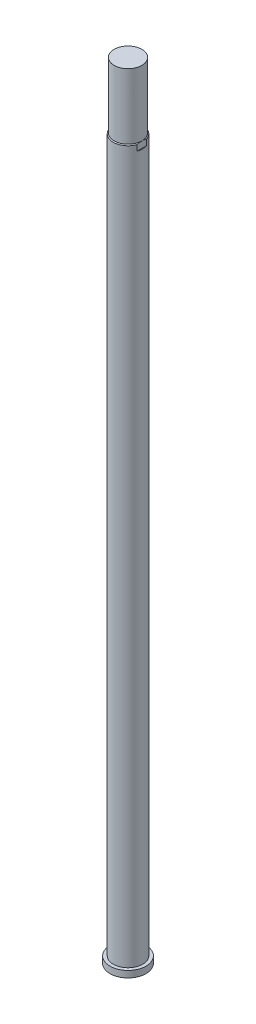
ISO-10303-21;
HEADER;
FILE_DESCRIPTION(('STEP AP214'),'2;1');
FILE_NAME('part.step','',(''),(''),'','','');
FILE_SCHEMA(('AUTOMOTIVE_DESIGN { 1 0 10303 214 1 1 1 1 }'));
ENDSEC;
DATA;
#1=APPLICATION_CONTEXT('core data for automotive mechanical design processes');
#2=APPLICATION_PROTOCOL_DEFINITION('international standard','automotive_design',2000,#1);
#3=PRODUCT_CONTEXT('',#1,'mechanical');
#4=PRODUCT('Part','Part','',(#3));
#5=PRODUCT_RELATED_PRODUCT_CATEGORY('part','',(#4));
#6=PRODUCT_DEFINITION_FORMATION('','',#4);
#7=PRODUCT_DEFINITION_CONTEXT('part definition',#1,'design');
#8=PRODUCT_DEFINITION('design','',#6,#7);
#9=PRODUCT_DEFINITION_SHAPE('','',#8);
#10=(LENGTH_UNIT() NAMED_UNIT(*) SI_UNIT(.MILLI.,.METRE.));
#11=(NAMED_UNIT(*) PLANE_ANGLE_UNIT() SI_UNIT($,.RADIAN.));
#12=(NAMED_UNIT(*) SI_UNIT($,.STERADIAN.) SOLID_ANGLE_UNIT());
#13=UNCERTAINTY_MEASURE_WITH_UNIT(LENGTH_MEASURE(1.E-05),#10,'distance_accuracy_value','');
#14=(GEOMETRIC_REPRESENTATION_CONTEXT(3) GLOBAL_UNCERTAINTY_ASSIGNED_CONTEXT((#13)) GLOBAL_UNIT_ASSIGNED_CONTEXT((#10,
#11,#12)) REPRESENTATION_CONTEXT('',''));
#15=CARTESIAN_POINT('',(0.,0.,0.));
#16=DIRECTION('',(0.,0.,1.));
#17=DIRECTION('',(1.,0.,0.));
#18=AXIS2_PLACEMENT_3D('',#15,#16,#17);
#19=CARTESIAN_POINT('',(0.,212.3276599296,0.));
#20=DIRECTION('',(0.,1.,0.));
#21=DIRECTION('',(0.,0.,1.));
#22=AXIS2_PLACEMENT_3D('',#19,#20,#21);
#23=CYLINDRICAL_SURFACE('',#22,4.50000000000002);
#24=CARTESIAN_POINT('',(0.,151.781851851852,0.));
#25=DIRECTION('',(0.,-1.,0.));
#26=DIRECTION('',(0.,0.,-1.));
#27=AXIS2_PLACEMENT_3D('',#24,#25,#26);
#28=CIRCLE('',#27,4.50000000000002);
#29=CARTESIAN_POINT('',(-4.25,151.781851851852,1.47901994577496));
#30=VERTEX_POINT('',#29);
#31=CARTESIAN_POINT('',(-4.25,151.781851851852,-1.47901994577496));
#32=VERTEX_POINT('',#31);
#33=EDGE_CURVE('E39',#30,#32,#28,.T.);
#34=ORIENTED_EDGE('',*,*,#33,.T.);
#35=DIRECTION('',(0.,1.,0.));
#36=VECTOR('',#35,1.);
#37=CARTESIAN_POINT('',(-4.25,212.3276599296,-1.47901994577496));
#38=LINE('',#37,#36);
#39=CARTESIAN_POINT('',(-4.25,153.531851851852,-1.47901994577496));
#40=VERTEX_POINT('',#39);
#41=EDGE_CURVE('E87',#32,#40,#38,.T.);
#42=ORIENTED_EDGE('',*,*,#41,.T.);
#43=CARTESIAN_POINT('',(0.,153.531851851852,0.));
#44=DIRECTION('',(0.,1.,0.));
#45=DIRECTION('',(0.,0.,1.));
#46=AXIS2_PLACEMENT_3D('',#43,#44,#45);
#47=CIRCLE('',#46,4.50000000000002);
#48=CARTESIAN_POINT('',(4.25,153.531851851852,-1.47901994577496));
#49=VERTEX_POINT('',#48);
#50=EDGE_CURVE('E110',#40,#49,#47,.F.);
#51=ORIENTED_EDGE('',*,*,#50,.T.);
#52=DIRECTION('',(0.,1.,0.));
#53=VECTOR('',#52,1.);
#54=CARTESIAN_POINT('',(4.25,212.3276599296,-1.47901994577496));
#55=LINE('',#54,#53);
#56=CARTESIAN_POINT('',(4.25,151.781851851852,-1.47901994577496));
#57=VERTEX_POINT('',#56);
#58=EDGE_CURVE('E102',#49,#57,#55,.F.);
#59=ORIENTED_EDGE('',*,*,#58,.T.);
#60=CARTESIAN_POINT('',(0.,151.781851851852,0.));
#61=DIRECTION('',(0.,1.,0.));
#62=DIRECTION('',(0.,0.,1.));
#63=AXIS2_PLACEMENT_3D('',#60,#61,#62);
#64=CIRCLE('',#63,4.50000000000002);
#65=CARTESIAN_POINT('',(4.25,151.781851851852,1.47901994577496));
#66=VERTEX_POINT('',#65);
#67=EDGE_CURVE('E121',#66,#57,#64,.T.);
#68=ORIENTED_EDGE('',*,*,#67,.F.);
#69=DIRECTION('',(0.,1.,0.));
#70=VECTOR('',#69,1.);
#71=CARTESIAN_POINT('',(4.25,212.3276599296,1.47901994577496));
#72=LINE('',#71,#70);
#73=CARTESIAN_POINT('',(4.25,153.531851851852,1.47901994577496));
#74=VERTEX_POINT('',#73);
#75=EDGE_CURVE('E105',#66,#74,#72,.T.);
#76=ORIENTED_EDGE('',*,*,#75,.T.);
#77=CARTESIAN_POINT('',(-4.25,153.531851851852,1.47901994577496));
#78=VERTEX_POINT('',#77);
#79=EDGE_CURVE('E94',#74,#78,#47,.F.);
#80=ORIENTED_EDGE('',*,*,#79,.T.);
#81=DIRECTION('',(0.,1.,0.));
#82=VECTOR('',#81,1.);
#83=CARTESIAN_POINT('',(-4.25,212.3276599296,1.47901994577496));
#84=LINE('',#83,#82);
#85=EDGE_CURVE('E86',#78,#30,#84,.F.);
#86=ORIENTED_EDGE('',*,*,#85,.T.);
#87=EDGE_LOOP('',(#34,#42,#51,#59,#68,#76,#80,#86));
#88=FACE_BOUND('',#87,.T.);
#89=CARTESIAN_POINT('',(0.,-64.2181481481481,0.));
#90=DIRECTION('',(0.,-1.,0.));
#91=DIRECTION('',(0.,0.,-1.));
#92=AXIS2_PLACEMENT_3D('',#89,#90,#91);
#93=CIRCLE('',#92,4.50000000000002);
#94=CARTESIAN_POINT('',(0.,-64.2181481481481,-4.50000000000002));
#95=VERTEX_POINT('',#94);
#96=EDGE_CURVE('E11',#95,#95,#93,.T.);
#97=ORIENTED_EDGE('',*,*,#96,.F.);
#98=EDGE_LOOP('',(#97));
#99=FACE_BOUND('',#98,.T.);
#100=ADVANCED_FACE('F30',(#88,#99),#23,.T.);
#101=CARTESIAN_POINT('',(0.,153.781851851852,0.));
#102=DIRECTION('',(0.,-1.,0.));
#103=DIRECTION('',(0.,0.,-1.));
#104=AXIS2_PLACEMENT_3D('',#101,#102,#103);
#105=CONICAL_SURFACE('',#104,4.24999999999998,0.78539816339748);
#106=CARTESIAN_POINT('',(-4.25,150.890506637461,-5.73901659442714));
#107=CARTESIAN_POINT('',(-4.25,151.000263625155,-5.60241118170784));
#108=CARTESIAN_POINT('',(-4.25,151.109209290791,-5.46514445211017));
#109=CARTESIAN_POINT('',(-4.25,151.32508923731,-5.18899490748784));
#110=CARTESIAN_POINT('',(-4.25,151.432023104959,-5.05011176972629));
#111=CARTESIAN_POINT('',(-4.25,151.644240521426,-4.76944015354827));
#112=CARTESIAN_POINT('',(-4.25,151.749505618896,-4.6276376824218));
#113=CARTESIAN_POINT('',(-4.25,151.956969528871,-4.34181590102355));
#114=CARTESIAN_POINT('',(-4.25,152.059168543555,-4.19779673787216));
#115=CARTESIAN_POINT('',(-4.25,152.267897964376,-3.89533166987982));
#116=CARTESIAN_POINT('',(-4.25,152.374107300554,-3.73666311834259));
#117=CARTESIAN_POINT('',(-4.25,152.580828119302,-3.41559056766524));
#118=CARTESIAN_POINT('',(-4.25,152.681338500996,-3.25318585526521));
#119=CARTESIAN_POINT('',(-4.25,152.874599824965,-2.92444583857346));
#120=CARTESIAN_POINT('',(-4.25,152.967373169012,-2.75812380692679));
#121=CARTESIAN_POINT('',(-4.25,153.143083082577,-2.42040251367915));
#122=CARTESIAN_POINT('',(-4.25,153.226024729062,-2.24900593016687));
#123=CARTESIAN_POINT('',(-4.25,153.368352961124,-1.92455506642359));
#124=CARTESIAN_POINT('',(-4.25,153.429410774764,-1.77224133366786));
#125=CARTESIAN_POINT('',(-4.25,153.53934629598,-1.46319592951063));
#126=CARTESIAN_POINT('',(-4.25,153.588223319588,-1.30646401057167));
#127=CARTESIAN_POINT('',(-4.25,153.67004168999,-0.992614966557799));
#128=CARTESIAN_POINT('',(-4.25,153.703319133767,-0.835587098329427));
#129=CARTESIAN_POINT('',(-4.25,153.753143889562,-0.518884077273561));
#130=CARTESIAN_POINT('',(-4.25,153.769696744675,-0.359209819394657));
#131=CARTESIAN_POINT('',(-4.25,153.784173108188,-0.0499229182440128));
#132=CARTESIAN_POINT('',(-4.25,153.783289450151,0.0996337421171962));
#133=CARTESIAN_POINT('',(-4.25,153.76586988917,0.397825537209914));
#134=CARTESIAN_POINT('',(-4.25,153.749332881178,0.546460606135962));
#135=CARTESIAN_POINT('',(-4.25,153.701346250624,0.844295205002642));
#136=CARTESIAN_POINT('',(-4.25,153.669606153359,0.993447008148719));
#137=CARTESIAN_POINT('',(-4.25,153.593159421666,1.28833123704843));
#138=CARTESIAN_POINT('',(-4.25,153.548452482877,1.4340635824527));
#139=CARTESIAN_POINT('',(-4.25,153.448907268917,1.72007572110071));
#140=CARTESIAN_POINT('',(-4.25,153.394192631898,1.86039917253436));
#141=CARTESIAN_POINT('',(-4.25,153.276273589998,2.13746405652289));
#142=CARTESIAN_POINT('',(-4.25,153.213065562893,2.27420393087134));
#143=CARTESIAN_POINT('',(-4.25,153.079659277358,2.54472002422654));
#144=CARTESIAN_POINT('',(-4.25,153.009440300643,2.67848594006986));
#145=CARTESIAN_POINT('',(-4.25,152.863547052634,2.94296402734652));
#146=CARTESIAN_POINT('',(-4.25,152.787873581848,3.07367664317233));
#147=CARTESIAN_POINT('',(-4.25,152.635994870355,3.32602029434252));
#148=CARTESIAN_POINT('',(-4.25,152.560002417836,3.44778008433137));
#149=CARTESIAN_POINT('',(-4.25,152.404755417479,3.68920803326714));
#150=CARTESIAN_POINT('',(-4.25,152.325500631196,3.80887603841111));
#151=CARTESIAN_POINT('',(-4.25,152.164941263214,4.04544692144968));
#152=CARTESIAN_POINT('',(-4.25,152.083657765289,4.16236416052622));
#153=CARTESIAN_POINT('',(-4.25,151.918889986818,4.39459107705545));
#154=CARTESIAN_POINT('',(-4.25,151.835406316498,4.50990118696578));
#155=CARTESIAN_POINT('',(-4.25,151.751021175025,4.62453608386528));
#156=B_SPLINE_CURVE_WITH_KNOTS('',3,(#106,#107,#108,#109,#110,#111,#112,#113,#114,#115,#116,
#117,#118,#119,#120,#121,#122,#123,#124,#125,#126,#127,#128,#129,#130,#131,#132,#133,#134,#135,
#136,#137,#138,#139,#140,#141,#142,#143,#144,#145,#146,#147,#148,#149,#150,#151,#152,#153,#154,
#155),.UNSPECIFIED.,.F.,.F.,(4,2,2,2,2,2,2,2,2,2,2,2,2,2,2,2,2,2,2,2,2,2,2,2,4),(0.,
0.525715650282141,1.05153813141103,1.58131379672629,2.11105445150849,2.68376405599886,
3.25658391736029,3.8276830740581,4.398486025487,4.89036648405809,5.38227455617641,
5.86303270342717,6.34363145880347,6.79147382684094,7.23934781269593,7.69614273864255,
8.15294838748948,8.60445104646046,9.05614687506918,9.50921942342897,9.9622256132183,
10.3927489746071,10.8233038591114,11.2504646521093,11.6775081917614),.UNSPECIFIED.);
#157=CARTESIAN_POINT('',(-4.25,153.781851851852,0.));
#158=VERTEX_POINT('',#157);
#159=EDGE_CURVE('E46',#78,#158,#156,.F.);
#160=ORIENTED_EDGE('',*,*,#159,.F.);
#161=ORIENTED_EDGE('',*,*,#79,.F.);
#162=CARTESIAN_POINT('',(4.25,153.059654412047,-2.58074550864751));
#163=CARTESIAN_POINT('',(4.25,153.133284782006,-2.43877734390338));
#164=CARTESIAN_POINT('',(4.25,153.203565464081,-2.29491758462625));
#165=CARTESIAN_POINT('',(4.25,153.335463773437,-2.00268929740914));
#166=CARTESIAN_POINT('',(4.25,153.397049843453,-1.85430660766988));
#167=CARTESIAN_POINT('',(4.25,153.508917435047,-1.55364537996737));
#168=CARTESIAN_POINT('',(4.25,153.55922389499,-1.40137628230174));
#169=CARTESIAN_POINT('',(4.25,153.646015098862,-1.0930970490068));
#170=CARTESIAN_POINT('',(4.25,153.682520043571,-0.937092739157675));
#171=CARTESIAN_POINT('',(4.25,153.729945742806,-0.674280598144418));
#172=CARTESIAN_POINT('',(4.25,153.745335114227,-0.56827192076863));
#173=CARTESIAN_POINT('',(4.25,153.768330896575,-0.355386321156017));
#174=CARTESIAN_POINT('',(4.25,153.775936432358,-0.248509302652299));
#175=CARTESIAN_POINT('',(4.25,153.783052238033,-0.0346475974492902));
#176=CARTESIAN_POINT('',(4.25,153.782574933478,0.0723366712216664));
#177=CARTESIAN_POINT('',(4.25,153.773580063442,0.285971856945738));
#178=CARTESIAN_POINT('',(4.25,153.765061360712,0.392622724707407));
#179=CARTESIAN_POINT('',(4.25,153.735293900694,0.647920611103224));
#180=CARTESIAN_POINT('',(4.25,153.710294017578,0.796137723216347));
#181=CARTESIAN_POINT('',(4.25,153.64670907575,1.08976674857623));
#182=CARTESIAN_POINT('',(4.25,153.608105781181,1.23517461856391));
#183=CARTESIAN_POINT('',(4.25,153.519088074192,1.5236675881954));
#184=CARTESIAN_POINT('',(4.25,153.46857236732,1.66672083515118));
#185=CARTESIAN_POINT('',(4.25,153.358189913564,1.94867504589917));
#186=CARTESIAN_POINT('',(4.25,153.298353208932,2.08758769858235));
#187=CARTESIAN_POINT('',(4.25,153.234822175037,2.22463339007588));
#188=B_SPLINE_CURVE_WITH_KNOTS('',3,(#162,#163,#164,#165,#166,#167,#168,#169,#170,#171,#172,
#173,#174,#175,#176,#177,#178,#179,#180,#181,#182,#183,#184,#185,#186,#187),.UNSPECIFIED.,.F.,
.F.,(4,2,2,2,2,2,2,2,2,2,2,2,4),(0.,0.479940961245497,0.961581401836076,1.44214623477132,
1.92200493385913,2.24310852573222,2.56424821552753,2.88489426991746,3.20558567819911,
3.65575814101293,4.10653638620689,4.56129549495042,5.01461810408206),.UNSPECIFIED.);
#189=CARTESIAN_POINT('',(4.25,153.781851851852,0.));
#190=VERTEX_POINT('',#189);
#191=EDGE_CURVE('E114',#190,#74,#188,.T.);
#192=ORIENTED_EDGE('',*,*,#191,.F.);
#193=CARTESIAN_POINT('',(0.,153.781851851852,0.));
#194=DIRECTION('',(0.,1.,0.));
#195=DIRECTION('',(0.,0.,1.));
#196=AXIS2_PLACEMENT_3D('',#193,#194,#195);
#197=CIRCLE('',#196,4.25);
#198=EDGE_CURVE('E53',#158,#190,#197,.T.);
#199=ORIENTED_EDGE('',*,*,#198,.F.);
#200=EDGE_LOOP('',(#160,#161,#192,#199));
#201=FACE_BOUND('',#200,.T.);
#202=ADVANCED_FACE('F135',(#201),#105,.T.);
#203=CARTESIAN_POINT('',(0.,153.781851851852,0.));
#204=DIRECTION('',(0.,1.,0.));
#205=DIRECTION('',(0.,0.,1.));
#206=AXIS2_PLACEMENT_3D('',#203,#204,#205);
#207=CYLINDRICAL_SURFACE('',#206,4.25);
#208=EDGE_CURVE('E108',#190,#158,#197,.T.);
#209=ORIENTED_EDGE('',*,*,#208,.T.);
#210=ORIENTED_EDGE('',*,*,#198,.T.);
#211=EDGE_LOOP('',(#209,#210));
#212=FACE_BOUND('',#211,.T.);
#213=CARTESIAN_POINT('',(0.,173.781851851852,0.));
#214=DIRECTION('',(0.,1.,0.));
#215=DIRECTION('',(0.,0.,1.));
#216=AXIS2_PLACEMENT_3D('',#213,#214,#215);
#217=CIRCLE('',#216,4.25);
#218=CARTESIAN_POINT('',(0.,173.781851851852,4.25));
#219=VERTEX_POINT('',#218);
#220=EDGE_CURVE('E107',#219,#219,#217,.T.);
#221=ORIENTED_EDGE('',*,*,#220,.F.);
#222=EDGE_LOOP('',(#221));
#223=FACE_BOUND('',#222,.T.);
#224=ADVANCED_FACE('F131',(#212,#223),#207,.T.);
#225=CARTESIAN_POINT('',(4.5,173.781851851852,0.));
#226=DIRECTION('',(0.,-1.,0.));
#227=DIRECTION('',(0.,0.,-1.));
#228=AXIS2_PLACEMENT_3D('',#225,#226,#227);
#229=PLANE('',#228);
#230=ORIENTED_EDGE('',*,*,#220,.T.);
#231=EDGE_LOOP('',(#230));
#232=FACE_BOUND('',#231,.T.);
#233=ADVANCED_FACE('F134',(#232),#229,.F.);
#234=EDGE_CURVE('E159',#158,#40,#156,.F.);
#235=ORIENTED_EDGE('',*,*,#234,.F.);
#236=ORIENTED_EDGE('',*,*,#208,.F.);
#237=EDGE_CURVE('E120',#49,#190,#188,.T.);
#238=ORIENTED_EDGE('',*,*,#237,.F.);
#239=ORIENTED_EDGE('',*,*,#50,.F.);
#240=EDGE_LOOP('',(#235,#236,#238,#239));
#241=FACE_BOUND('',#240,.T.);
#242=ADVANCED_FACE('F32',(#241),#105,.T.);
#243=CARTESIAN_POINT('',(4.25,151.781851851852,2.95999999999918));
#244=DIRECTION('',(0.,1.,0.));
#245=DIRECTION('',(0.,0.,1.));
#246=AXIS2_PLACEMENT_3D('',#243,#244,#245);
#247=PLANE('',#246);
#248=ORIENTED_EDGE('',*,*,#67,.T.);
#249=DIRECTION('',(0.,0.,1.));
#250=VECTOR('',#249,1.);
#251=CARTESIAN_POINT('',(4.25,151.781851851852,-3.00800000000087));
#252=LINE('',#251,#250);
#253=EDGE_CURVE('E96',#57,#66,#252,.T.);
#254=ORIENTED_EDGE('',*,*,#253,.T.);
#255=EDGE_LOOP('',(#248,#254));
#256=FACE_BOUND('',#255,.T.);
#257=ADVANCED_FACE('F128',(#256),#247,.T.);
#258=CARTESIAN_POINT('',(4.25,151.781851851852,-3.00800000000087));
#259=DIRECTION('',(-1.,0.,0.));
#260=DIRECTION('',(0.,0.,1.));
#261=AXIS2_PLACEMENT_3D('',#258,#259,#260);
#262=PLANE('',#261);
#263=ORIENTED_EDGE('',*,*,#253,.F.);
#264=ORIENTED_EDGE('',*,*,#58,.F.);
#265=ORIENTED_EDGE('',*,*,#237,.T.);
#266=ORIENTED_EDGE('',*,*,#191,.T.);
#267=ORIENTED_EDGE('',*,*,#75,.F.);
#268=EDGE_LOOP('',(#263,#264,#265,#266,#267));
#269=FACE_BOUND('',#268,.T.);
#270=ADVANCED_FACE('F123',(#269),#262,.F.);
#271=CARTESIAN_POINT('',(-4.25,151.781851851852,3.13599999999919));
#272=DIRECTION('',(0.,-1.,0.));
#273=DIRECTION('',(0.,0.,-1.));
#274=AXIS2_PLACEMENT_3D('',#271,#272,#273);
#275=PLANE('',#274);
#276=DIRECTION('',(0.,0.,-1.));
#277=VECTOR('',#276,1.);
#278=CARTESIAN_POINT('',(-4.25,151.781851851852,-3.00800000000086));
#279=LINE('',#278,#277);
#280=EDGE_CURVE('E81',#30,#32,#279,.T.);
#281=ORIENTED_EDGE('',*,*,#280,.T.);
#282=ORIENTED_EDGE('',*,*,#33,.F.);
#283=EDGE_LOOP('',(#281,#282));
#284=FACE_BOUND('',#283,.T.);
#285=ADVANCED_FACE('F80',(#284),#275,.F.);
#286=CARTESIAN_POINT('',(-4.25,151.781851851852,-3.00800000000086));
#287=DIRECTION('',(1.,0.,0.));
#288=DIRECTION('',(0.,0.,-1.));
#289=AXIS2_PLACEMENT_3D('',#286,#287,#288);
#290=PLANE('',#289);
#291=ORIENTED_EDGE('',*,*,#280,.F.);
#292=ORIENTED_EDGE('',*,*,#85,.F.);
#293=ORIENTED_EDGE('',*,*,#159,.T.);
#294=ORIENTED_EDGE('',*,*,#234,.T.);
#295=ORIENTED_EDGE('',*,*,#41,.F.);
#296=EDGE_LOOP('',(#291,#292,#293,#294,#295));
#297=FACE_BOUND('',#296,.T.);
#298=ADVANCED_FACE('F85',(#297),#290,.F.);
#299=CARTESIAN_POINT('',(0.,-64.2181481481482,0.));
#300=DIRECTION('',(0.,-1.,0.));
#301=DIRECTION('',(0.,0.,-1.));
#302=AXIS2_PLACEMENT_3D('',#299,#300,#301);
#303=PLANE('',#302);
#304=CARTESIAN_POINT('',(0.,-64.2181481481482,0.));
#305=DIRECTION('',(0.,-1.,0.));
#306=DIRECTION('',(0.,0.,-1.));
#307=AXIS2_PLACEMENT_3D('',#304,#305,#306);
#308=CIRCLE('',#307,5.5);
#309=CARTESIAN_POINT('',(0.,-64.2181481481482,-5.5));
#310=VERTEX_POINT('',#309);
#311=EDGE_CURVE('E88',#310,#310,#308,.T.);
#312=ORIENTED_EDGE('',*,*,#311,.F.);
#313=EDGE_LOOP('',(#312));
#314=FACE_BOUND('',#313,.T.);
#315=ORIENTED_EDGE('',*,*,#96,.T.);
#316=EDGE_LOOP('',(#315));
#317=FACE_BOUND('',#316,.T.);
#318=ADVANCED_FACE('F166',(#314,#317),#303,.F.);
#319=CARTESIAN_POINT('',(0.,-64.2181481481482,0.));
#320=DIRECTION('',(0.,-1.,0.));
#321=DIRECTION('',(0.,0.,-1.));
#322=AXIS2_PLACEMENT_3D('',#319,#320,#321);
#323=CYLINDRICAL_SURFACE('',#322,5.5);
#324=ORIENTED_EDGE('',*,*,#311,.T.);
#325=EDGE_LOOP('',(#324));
#326=FACE_BOUND('',#325,.T.);
#327=CARTESIAN_POINT('',(0.,-66.2181481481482,0.));
#328=DIRECTION('',(0.,-1.,0.));
#329=DIRECTION('',(0.,0.,-1.));
#330=AXIS2_PLACEMENT_3D('',#327,#328,#329);
#331=CIRCLE('',#330,5.5);
#332=CARTESIAN_POINT('',(0.,-66.2181481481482,-5.5));
#333=VERTEX_POINT('',#332);
#334=EDGE_CURVE('E180',#333,#333,#331,.T.);
#335=ORIENTED_EDGE('',*,*,#334,.F.);
#336=EDGE_LOOP('',(#335));
#337=FACE_BOUND('',#336,.T.);
#338=ADVANCED_FACE('F140',(#326,#337),#323,.T.);
#339=CARTESIAN_POINT('',(4.50000000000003,-66.2181481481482,0.));
#340=DIRECTION('',(0.,1.,0.));
#341=DIRECTION('',(0.,0.,1.));
#342=AXIS2_PLACEMENT_3D('',#339,#340,#341);
#343=PLANE('',#342);
#344=ORIENTED_EDGE('',*,*,#334,.T.);
#345=EDGE_LOOP('',(#344));
#346=FACE_BOUND('',#345,.T.);
#347=ADVANCED_FACE('F138',(#346),#343,.F.);
#348=CLOSED_SHELL('',(#100,#202,#224,#233,#242,#257,#270,#285,#298,#318,#338,#347));
#349=MANIFOLD_SOLID_BREP('B2',#348);
#350=ADVANCED_BREP_SHAPE_REPRESENTATION('',(#18,#349),#14);
#351=SHAPE_DEFINITION_REPRESENTATION(#9,#350);
ENDSEC;
END-ISO-10303-21;
